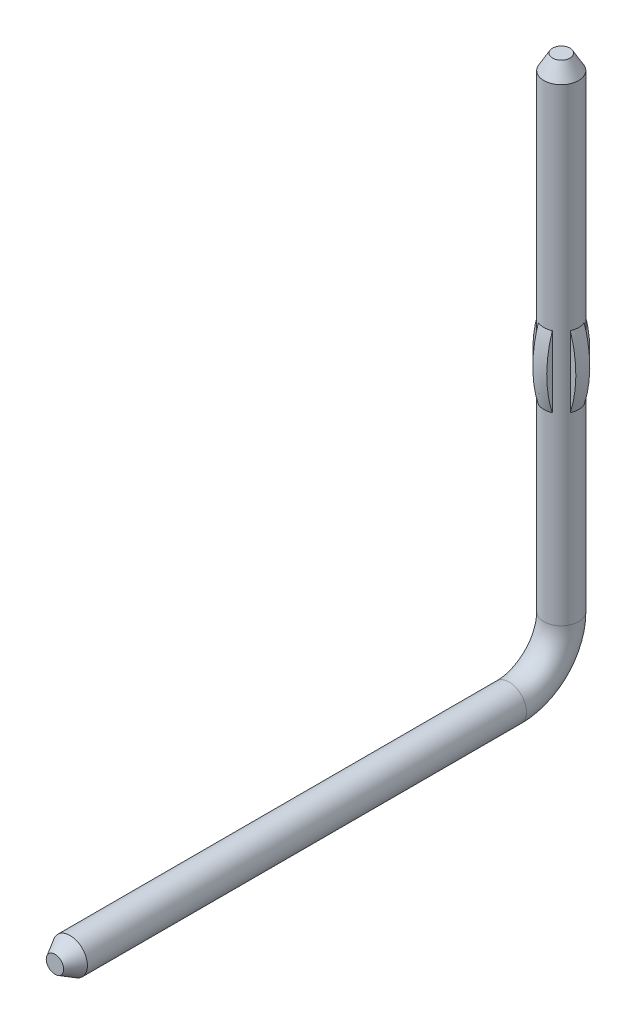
ISO-10303-21;
HEADER;
FILE_DESCRIPTION(('STEP AP214'),'2;1');
FILE_NAME('part.step','',(''),(''),'','','');
FILE_SCHEMA(('AUTOMOTIVE_DESIGN { 1 0 10303 214 1 1 1 1 }'));
ENDSEC;
DATA;
#1=APPLICATION_CONTEXT('core data for automotive mechanical design processes');
#2=APPLICATION_PROTOCOL_DEFINITION('international standard','automotive_design',2000,#1);
#3=PRODUCT_CONTEXT('',#1,'mechanical');
#4=PRODUCT('Part','Part','',(#3));
#5=PRODUCT_RELATED_PRODUCT_CATEGORY('part','',(#4));
#6=PRODUCT_DEFINITION_FORMATION('','',#4);
#7=PRODUCT_DEFINITION_CONTEXT('part definition',#1,'design');
#8=PRODUCT_DEFINITION('design','',#6,#7);
#9=PRODUCT_DEFINITION_SHAPE('','',#8);
#10=(LENGTH_UNIT() NAMED_UNIT(*) SI_UNIT(.MILLI.,.METRE.));
#11=(NAMED_UNIT(*) PLANE_ANGLE_UNIT() SI_UNIT($,.RADIAN.));
#12=(NAMED_UNIT(*) SI_UNIT($,.STERADIAN.) SOLID_ANGLE_UNIT());
#13=UNCERTAINTY_MEASURE_WITH_UNIT(LENGTH_MEASURE(1.E-05),#10,'distance_accuracy_value','');
#14=(GEOMETRIC_REPRESENTATION_CONTEXT(3) GLOBAL_UNCERTAINTY_ASSIGNED_CONTEXT((#13)) GLOBAL_UNIT_ASSIGNED_CONTEXT((#10,
#11,#12)) REPRESENTATION_CONTEXT('',''));
#15=CARTESIAN_POINT('',(0.,0.,0.));
#16=DIRECTION('',(0.,0.,1.));
#17=DIRECTION('',(1.,0.,0.));
#18=AXIS2_PLACEMENT_3D('',#15,#16,#17);
#19=CARTESIAN_POINT('',(3.861265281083,-2.661779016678,6.275));
#20=DIRECTION('',(0.,0.,1.));
#21=DIRECTION('',(0.,-1.,0.));
#22=AXIS2_PLACEMENT_3D('',#19,#20,#21);
#23=PLANE('',#22);
#24=CARTESIAN_POINT('',(4.,-2.8,6.27500000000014));
#25=DIRECTION('',(0.,0.,-1.));
#26=DIRECTION('',(-1.,0.,0.));
#27=AXIS2_PLACEMENT_3D('',#24,#25,#26);
#28=CIRCLE('',#27,0.124999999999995);
#29=CARTESIAN_POINT('',(3.875,-2.8,6.27500000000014));
#30=VERTEX_POINT('',#29);
#31=EDGE_CURVE('E21',#30,#30,#28,.F.);
#32=ORIENTED_EDGE('',*,*,#31,.T.);
#33=EDGE_LOOP('',(#32));
#34=FACE_BOUND('',#33,.T.);
#35=ADVANCED_FACE('F17',(#34),#23,.T.);
#36=CARTESIAN_POINT('',(4.,-2.8,6.05849364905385));
#37=DIRECTION('',(0.,0.,-1.));
#38=DIRECTION('',(-1.,0.,0.));
#39=AXIS2_PLACEMENT_3D('',#36,#37,#38);
#40=CONICAL_SURFACE('',#39,0.25000000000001,0.523598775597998);
#41=CARTESIAN_POINT('',(4.,-2.8,6.05849364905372));
#42=DIRECTION('',(0.,0.,1.));
#43=DIRECTION('',(0.,-1.,0.));
#44=AXIS2_PLACEMENT_3D('',#41,#42,#43);
#45=CIRCLE('',#44,0.25);
#46=CARTESIAN_POINT('',(4.,-3.05,6.05849364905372));
#47=VERTEX_POINT('',#46);
#48=EDGE_CURVE('E417',#47,#47,#45,.T.);
#49=ORIENTED_EDGE('',*,*,#48,.T.);
#50=EDGE_LOOP('',(#49));
#51=FACE_BOUND('',#50,.T.);
#52=ORIENTED_EDGE('',*,*,#31,.F.);
#53=EDGE_LOOP('',(#52));
#54=FACE_BOUND('',#53,.T.);
#55=ADVANCED_FACE('F174',(#51,#54),#40,.T.);
#56=CARTESIAN_POINT('',(4.,-2.8,-0.250000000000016));
#57=DIRECTION('',(0.,0.,1.));
#58=DIRECTION('',(1.,0.,0.));
#59=AXIS2_PLACEMENT_3D('',#56,#57,#58);
#60=CYLINDRICAL_SURFACE('',#59,0.25);
#61=ORIENTED_EDGE('',*,*,#48,.F.);
#62=EDGE_LOOP('',(#61));
#63=FACE_BOUND('',#62,.T.);
#64=CARTESIAN_POINT('',(4.,-2.8,-0.250000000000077));
#65=DIRECTION('',(0.,1.03212393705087E-13,-1.));
#66=DIRECTION('',(0.0627905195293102,-0.998026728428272,-1.03008727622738E-13));
#67=AXIS2_PLACEMENT_3D('',#64,#65,#66);
#68=CIRCLE('',#67,0.25);
#69=CARTESIAN_POINT('',(4.01569762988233,-3.04950668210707,-0.250000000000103));
#70=VERTEX_POINT('',#69);
#71=EDGE_CURVE('E88',#70,#70,#68,.F.);
#72=ORIENTED_EDGE('',*,*,#71,.T.);
#73=EDGE_LOOP('',(#72));
#74=FACE_BOUND('',#73,.T.);
#75=ADVANCED_FACE('F170',(#63,#74),#60,.T.);
#76=CARTESIAN_POINT('',(4.1,0.5696,-0.6775460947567));
#77=DIRECTION('',(1.,0.,0.));
#78=DIRECTION('',(0.,0.,-1.));
#79=AXIS2_PLACEMENT_3D('',#76,#77,#78);
#80=PLANE('',#79);
#81=CARTESIAN_POINT('',(4.1,1.60999999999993,-0.770871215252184));
#82=CARTESIAN_POINT('',(4.1,1.57873023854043,-0.760624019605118));
#83=CARTESIAN_POINT('',(4.1,1.54713852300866,-0.751389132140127));
#84=CARTESIAN_POINT('',(4.1,1.48345199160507,-0.734904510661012));
#85=CARTESIAN_POINT('',(4.1,1.45135734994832,-0.727654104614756));
#86=CARTESIAN_POINT('',(4.1,1.35425691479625,-0.708764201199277));
#87=CARTESIAN_POINT('',(4.1,1.2886698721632,-0.700061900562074));
#88=CARTESIAN_POINT('',(4.1,1.1285416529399,-0.688361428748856));
#89=CARTESIAN_POINT('',(4.1,1.03366604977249,-0.689419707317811));
#90=CARTESIAN_POINT('',(4.1,0.892730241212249,-0.702910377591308));
#91=CARTESIAN_POINT('',(4.1,0.846013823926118,-0.709382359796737));
#92=CARTESIAN_POINT('',(4.1,0.753312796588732,-0.726300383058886));
#93=CARTESIAN_POINT('',(4.1,0.707327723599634,-0.736743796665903));
#94=CARTESIAN_POINT('',(4.1,0.63776992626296,-0.755862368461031));
#95=CARTESIAN_POINT('',(4.1,0.613787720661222,-0.763074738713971));
#96=CARTESIAN_POINT('',(4.1,0.589999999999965,-0.770871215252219));
#97=B_SPLINE_CURVE_WITH_KNOTS('',3,(#81,#82,#83,#84,#85,#86,#87,#88,#89,#90,#91,#92,#93,#94,#95,
#96),.UNSPECIFIED.,.F.,.F.,(4,2,2,2,2,2,2,4),(0.,0.0986850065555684,0.197336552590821,
0.395376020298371,0.678491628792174,0.819849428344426,0.961113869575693,1.03621412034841),.UNSPECIFIED.);
#98=CARTESIAN_POINT('',(4.10000000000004,1.60999999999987,-0.770871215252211));
#99=VERTEX_POINT('',#98);
#100=CARTESIAN_POINT('',(4.10000000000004,0.589999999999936,-0.770871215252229));
#101=VERTEX_POINT('',#100);
#102=EDGE_CURVE('E155',#99,#101,#97,.T.);
#103=ORIENTED_EDGE('',*,*,#102,.T.);
#104=DIRECTION('',(0.,1.,0.));
#105=VECTOR('',#104,1.);
#106=CARTESIAN_POINT('',(4.10000000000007,1.316746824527,-0.770871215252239));
#107=LINE('',#106,#105);
#108=EDGE_CURVE('E405',#101,#99,#107,.T.);
#109=ORIENTED_EDGE('',*,*,#108,.T.);
#110=EDGE_LOOP('',(#103,#109));
#111=FACE_BOUND('',#110,.T.);
#112=ADVANCED_FACE('F166',(#111),#80,.T.);
#113=CARTESIAN_POINT('',(4.1,0.5696,-1.322453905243));
#114=DIRECTION('',(-1.,0.,0.));
#115=DIRECTION('',(0.,0.,1.));
#116=AXIS2_PLACEMENT_3D('',#113,#114,#115);
#117=PLANE('',#116);
#118=CARTESIAN_POINT('',(4.1,0.589999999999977,-1.22912878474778));
#119=CARTESIAN_POINT('',(4.1,0.621269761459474,-1.23937598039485));
#120=CARTESIAN_POINT('',(4.1,0.65286147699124,-1.24861086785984));
#121=CARTESIAN_POINT('',(4.1,0.716548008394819,-1.26509548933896));
#122=CARTESIAN_POINT('',(4.1,0.748642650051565,-1.27234589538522));
#123=CARTESIAN_POINT('',(4.1,0.845743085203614,-1.2912357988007));
#124=CARTESIAN_POINT('',(4.1,0.911330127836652,-1.29993809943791));
#125=CARTESIAN_POINT('',(4.1,1.07145834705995,-1.31163857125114));
#126=CARTESIAN_POINT('',(4.1,1.16633395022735,-1.3105802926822));
#127=CARTESIAN_POINT('',(4.1,1.3072697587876,-1.29708962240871));
#128=CARTESIAN_POINT('',(4.1,1.35398617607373,-1.29061764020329));
#129=CARTESIAN_POINT('',(4.1,1.44668720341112,-1.27369961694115));
#130=CARTESIAN_POINT('',(4.1,1.49267227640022,-1.26325620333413));
#131=CARTESIAN_POINT('',(4.1,1.5622300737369,-1.24413763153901));
#132=CARTESIAN_POINT('',(4.1,1.58621227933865,-1.23692526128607));
#133=CARTESIAN_POINT('',(4.1,1.60999999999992,-1.22912878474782));
#134=B_SPLINE_CURVE_WITH_KNOTS('',3,(#118,#119,#120,#121,#122,#123,#124,#125,#126,#127,#128,
#129,#130,#131,#132,#133),.UNSPECIFIED.,.F.,.F.,(4,2,2,2,2,2,2,4),(0.,0.0986850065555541,
0.197336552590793,0.395376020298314,0.678491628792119,0.819849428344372,0.96111386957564,
1.03621412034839),.UNSPECIFIED.);
#135=CARTESIAN_POINT('',(4.1,0.589999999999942,-1.22912878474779));
#136=VERTEX_POINT('',#135);
#137=CARTESIAN_POINT('',(4.1,1.60999999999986,-1.22912878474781));
#138=VERTEX_POINT('',#137);
#139=EDGE_CURVE('E258',#136,#138,#134,.T.);
#140=ORIENTED_EDGE('',*,*,#139,.T.);
#141=DIRECTION('',(0.,-1.,0.));
#142=VECTOR('',#141,1.);
#143=CARTESIAN_POINT('',(4.1,1.316746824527,-1.22912878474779));
#144=LINE('',#143,#142);
#145=EDGE_CURVE('E101',#138,#136,#144,.T.);
#146=ORIENTED_EDGE('',*,*,#145,.T.);
#147=EDGE_LOOP('',(#140,#146));
#148=FACE_BOUND('',#147,.T.);
#149=ADVANCED_FACE('F135',(#148),#117,.F.);
#150=CARTESIAN_POINT('',(4.,-2.05,-0.25));
#151=DIRECTION('',(-1.,0.,0.));
#152=DIRECTION('',(0.,0.,1.));
#153=AXIS2_PLACEMENT_3D('',#150,#151,#152);
#154=TOROIDAL_SURFACE('',#153,0.75,0.25);
#155=ORIENTED_EDGE('',*,*,#71,.F.);
#156=EDGE_LOOP('',(#155));
#157=FACE_BOUND('',#156,.T.);
#158=CARTESIAN_POINT('',(4.,-2.04999999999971,-1.));
#159=DIRECTION('',(0.,-1.,0.));
#160=DIRECTION('',(0.,0.,-1.));
#161=AXIS2_PLACEMENT_3D('',#158,#159,#160);
#162=CIRCLE('',#161,0.25);
#163=CARTESIAN_POINT('',(4.,-2.04999999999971,-1.25));
#164=VERTEX_POINT('',#163);
#165=EDGE_CURVE('E98',#164,#164,#162,.T.);
#166=ORIENTED_EDGE('',*,*,#165,.T.);
#167=EDGE_LOOP('',(#166));
#168=FACE_BOUND('',#167,.T.);
#169=ADVANCED_FACE('F119',(#157,#168),#154,.T.);
#170=CARTESIAN_POINT('',(4.215907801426,0.5696,-0.9));
#171=DIRECTION('',(0.,0.,1.));
#172=DIRECTION('',(1.,0.,0.));
#173=AXIS2_PLACEMENT_3D('',#170,#171,#172);
#174=PLANE('',#173);
#175=CARTESIAN_POINT('',(4.22912878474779,0.589999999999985,-0.9));
#176=CARTESIAN_POINT('',(4.23937598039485,0.621269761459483,-0.9));
#177=CARTESIAN_POINT('',(4.24861086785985,0.652861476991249,-0.9));
#178=CARTESIAN_POINT('',(4.26509548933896,0.71654800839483,-0.9));
#179=CARTESIAN_POINT('',(4.27234589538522,0.748642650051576,-0.9));
#180=CARTESIAN_POINT('',(4.2912357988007,0.845743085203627,-0.9));
#181=CARTESIAN_POINT('',(4.29993809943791,0.911330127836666,-0.900000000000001));
#182=CARTESIAN_POINT('',(4.31163857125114,1.07145834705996,-0.900000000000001));
#183=CARTESIAN_POINT('',(4.31058029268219,1.16633395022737,-0.9));
#184=CARTESIAN_POINT('',(4.29708962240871,1.30726975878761,-0.9));
#185=CARTESIAN_POINT('',(4.29061764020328,1.35398617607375,-0.9));
#186=CARTESIAN_POINT('',(4.27369961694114,1.44668720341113,-0.9));
#187=CARTESIAN_POINT('',(4.26325620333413,1.49267227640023,-0.9));
#188=CARTESIAN_POINT('',(4.24413763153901,1.56223007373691,-0.9));
#189=CARTESIAN_POINT('',(4.23692526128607,1.58621227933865,-0.9));
#190=CARTESIAN_POINT('',(4.22912878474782,1.60999999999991,-0.9));
#191=B_SPLINE_CURVE_WITH_KNOTS('',3,(#175,#176,#177,#178,#179,#180,#181,#182,#183,#184,#185,
#186,#187,#188,#189,#190),.UNSPECIFIED.,.F.,.F.,(4,2,2,2,2,2,2,4),(0.,0.0986850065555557,
0.197336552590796,0.39537602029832,0.678491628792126,0.819849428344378,0.961113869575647,
1.03621412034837),.UNSPECIFIED.);
#192=CARTESIAN_POINT('',(4.22912878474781,0.589999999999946,-0.900000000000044));
#193=VERTEX_POINT('',#192);
#194=CARTESIAN_POINT('',(4.22912878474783,1.60999999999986,-0.900000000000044));
#195=VERTEX_POINT('',#194);
#196=EDGE_CURVE('E80',#193,#195,#191,.T.);
#197=ORIENTED_EDGE('',*,*,#196,.T.);
#198=DIRECTION('',(0.,-1.,0.));
#199=VECTOR('',#198,1.);
#200=CARTESIAN_POINT('',(4.22912878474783,1.316746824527,-0.900000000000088));
#201=LINE('',#200,#199);
#202=EDGE_CURVE('E86',#195,#193,#201,.T.);
#203=ORIENTED_EDGE('',*,*,#202,.T.);
#204=EDGE_LOOP('',(#197,#203));
#205=FACE_BOUND('',#204,.T.);
#206=ADVANCED_FACE('F85',(#205),#174,.T.);
#207=CARTESIAN_POINT('',(4.,1.1,-2.4465));
#208=DIRECTION('',(1.,0.,0.));
#209=DIRECTION('',(0.,0.299058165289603,0.95423488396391));
#210=AXIS2_PLACEMENT_3D('',#207,#208,#209);
#211=CIRCLE('',#210,1.7715);
#212=TRIMMED_CURVE('',#211,(PARAMETER_VALUE(-0.31169960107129)),
(PARAMETER_VALUE(0.919110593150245)),.T.,.PARAMETER.);
#213=CARTESIAN_POINT('',(4.,1.1,-1.));
#214=DIRECTION('',(0.,-1.,0.));
#215=AXIS1_PLACEMENT('',#213,#214);
#216=SURFACE_OF_REVOLUTION('',#212,#215);
#217=CARTESIAN_POINT('',(4.22912878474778,0.589999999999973,-1.1));
#218=CARTESIAN_POINT('',(4.23937598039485,0.62126976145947,-1.1));
#219=CARTESIAN_POINT('',(4.24861086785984,0.652861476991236,-1.1));
#220=CARTESIAN_POINT('',(4.26509548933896,0.716548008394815,-1.1));
#221=CARTESIAN_POINT('',(4.27234589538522,0.74864265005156,-1.1));
#222=CARTESIAN_POINT('',(4.2912357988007,0.845743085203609,-1.1));
#223=CARTESIAN_POINT('',(4.29993809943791,0.911330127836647,-1.1));
#224=CARTESIAN_POINT('',(4.31163857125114,1.07145834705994,-1.1));
#225=CARTESIAN_POINT('',(4.31058029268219,1.16633395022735,-1.1));
#226=CARTESIAN_POINT('',(4.29708962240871,1.30726975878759,-1.1));
#227=CARTESIAN_POINT('',(4.29061764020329,1.35398617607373,-1.1));
#228=CARTESIAN_POINT('',(4.27369961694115,1.44668720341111,-1.1));
#229=CARTESIAN_POINT('',(4.26325620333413,1.49267227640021,-1.1));
#230=CARTESIAN_POINT('',(4.24413763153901,1.5622300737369,-1.1));
#231=CARTESIAN_POINT('',(4.23692526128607,1.58621227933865,-1.1));
#232=CARTESIAN_POINT('',(4.22912878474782,1.60999999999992,-1.1));
#233=B_SPLINE_CURVE_WITH_KNOTS('',3,(#217,#218,#219,#220,#221,#222,#223,#224,#225,#226,#227,
#228,#229,#230,#231,#232),.UNSPECIFIED.,.F.,.F.,(4,2,2,2,2,2,2,4),(0.,0.0986850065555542,
0.197336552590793,0.395376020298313,0.678491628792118,0.819849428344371,0.961113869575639,
1.0362141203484),.UNSPECIFIED.);
#234=CARTESIAN_POINT('',(4.22912878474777,0.58999999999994,-1.10000000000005));
#235=VERTEX_POINT('',#234);
#236=CARTESIAN_POINT('',(4.22912878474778,1.60999999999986,-1.10000000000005));
#237=VERTEX_POINT('',#236);
#238=EDGE_CURVE('E87',#235,#237,#233,.T.);
#239=ORIENTED_EDGE('',*,*,#238,.T.);
#240=CARTESIAN_POINT('',(4.,1.60999999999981,-1.));
#241=DIRECTION('',(0.,-1.,0.));
#242=DIRECTION('',(0.,0.,-1.));
#243=AXIS2_PLACEMENT_3D('',#240,#241,#242);
#244=CIRCLE('',#243,0.25);
#245=EDGE_CURVE('E92',#237,#195,#244,.T.);
#246=ORIENTED_EDGE('',*,*,#245,.T.);
#247=ORIENTED_EDGE('',*,*,#196,.F.);
#248=CARTESIAN_POINT('',(4.,0.589999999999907,-1.));
#249=DIRECTION('',(0.,-1.,0.));
#250=DIRECTION('',(0.,0.,-1.));
#251=AXIS2_PLACEMENT_3D('',#248,#249,#250);
#252=CIRCLE('',#251,0.25);
#253=EDGE_CURVE('E94',#193,#235,#252,.F.);
#254=ORIENTED_EDGE('',*,*,#253,.T.);
#255=EDGE_LOOP('',(#239,#246,#247,#254));
#256=FACE_BOUND('',#255,.T.);
#257=ADVANCED_FACE('F96',(#256),#216,.T.);
#258=CARTESIAN_POINT('',(4.215907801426,0.5696,-1.1));
#259=DIRECTION('',(0.,0.,1.));
#260=DIRECTION('',(1.,0.,0.));
#261=AXIS2_PLACEMENT_3D('',#258,#259,#260);
#262=PLANE('',#261);
#263=ORIENTED_EDGE('',*,*,#238,.F.);
#264=DIRECTION('',(0.,1.,0.));
#265=VECTOR('',#264,1.);
#266=CARTESIAN_POINT('',(4.22912878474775,1.316746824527,-1.10000000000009));
#267=LINE('',#266,#265);
#268=EDGE_CURVE('E105',#235,#237,#267,.T.);
#269=ORIENTED_EDGE('',*,*,#268,.T.);
#270=EDGE_LOOP('',(#263,#269));
#271=FACE_BOUND('',#270,.T.);
#272=ADVANCED_FACE('F114',(#271),#262,.F.);
#273=CARTESIAN_POINT('',(3.9,0.5696,-0.6775460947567));
#274=DIRECTION('',(1.,0.,0.));
#275=DIRECTION('',(0.,0.,-1.));
#276=AXIS2_PLACEMENT_3D('',#273,#274,#275);
#277=PLANE('',#276);
#278=CARTESIAN_POINT('',(3.9,0.589999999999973,-0.770871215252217));
#279=CARTESIAN_POINT('',(3.9,0.621269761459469,-0.76062401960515));
#280=CARTESIAN_POINT('',(3.9,0.652861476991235,-0.751389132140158));
#281=CARTESIAN_POINT('',(3.9,0.716548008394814,-0.734904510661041));
#282=CARTESIAN_POINT('',(3.9,0.74864265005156,-0.727654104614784));
#283=CARTESIAN_POINT('',(3.9,0.845743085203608,-0.708764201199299));
#284=CARTESIAN_POINT('',(3.9,0.911330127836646,-0.700061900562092));
#285=CARTESIAN_POINT('',(3.9,1.07145834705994,-0.688361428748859));
#286=CARTESIAN_POINT('',(3.9,1.16633395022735,-0.689419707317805));
#287=CARTESIAN_POINT('',(3.9,1.30726975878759,-0.702910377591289));
#288=CARTESIAN_POINT('',(3.9,1.35398617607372,-0.709382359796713));
#289=CARTESIAN_POINT('',(3.9,1.44668720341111,-0.726300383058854));
#290=CARTESIAN_POINT('',(3.9,1.49267227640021,-0.736743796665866));
#291=CARTESIAN_POINT('',(3.9,1.5622300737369,-0.755862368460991));
#292=CARTESIAN_POINT('',(3.9,1.58621227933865,-0.763074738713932));
#293=CARTESIAN_POINT('',(3.9,1.60999999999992,-0.770871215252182));
#294=B_SPLINE_CURVE_WITH_KNOTS('',3,(#278,#279,#280,#281,#282,#283,#284,#285,#286,#287,#288,
#289,#290,#291,#292,#293),.UNSPECIFIED.,.F.,.F.,(4,2,2,2,2,2,2,4),(0.,0.0986850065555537,
0.197336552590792,0.395376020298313,0.678491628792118,0.819849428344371,0.961113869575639,
1.0362141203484),.UNSPECIFIED.);
#295=CARTESIAN_POINT('',(3.90000000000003,0.58999999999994,-0.770871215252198));
#296=VERTEX_POINT('',#295);
#297=CARTESIAN_POINT('',(3.90000000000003,1.60999999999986,-0.770871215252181));
#298=VERTEX_POINT('',#297);
#299=EDGE_CURVE('E150',#296,#298,#294,.T.);
#300=ORIENTED_EDGE('',*,*,#299,.T.);
#301=DIRECTION('',(0.,-1.,0.));
#302=VECTOR('',#301,1.);
#303=CARTESIAN_POINT('',(3.90000000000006,1.316746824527,-0.77087121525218));
#304=LINE('',#303,#302);
#305=EDGE_CURVE('E226',#298,#296,#304,.T.);
#306=ORIENTED_EDGE('',*,*,#305,.T.);
#307=EDGE_LOOP('',(#300,#306));
#308=FACE_BOUND('',#307,.T.);
#309=ADVANCED_FACE('F141',(#308),#277,.F.);
#310=CARTESIAN_POINT('',(4.,1.1,-2.4465));
#311=DIRECTION('',(1.,0.,0.));
#312=DIRECTION('',(0.,0.299058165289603,0.95423488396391));
#313=AXIS2_PLACEMENT_3D('',#310,#311,#312);
#314=CIRCLE('',#313,1.7715);
#315=TRIMMED_CURVE('',#314,(PARAMETER_VALUE(-0.31169960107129)),
(PARAMETER_VALUE(0.919110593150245)),.T.,.PARAMETER.);
#316=CARTESIAN_POINT('',(4.,1.1,-1.));
#317=DIRECTION('',(0.,-1.,0.));
#318=AXIS1_PLACEMENT('',#316,#317);
#319=SURFACE_OF_REVOLUTION('',#315,#318);
#320=CARTESIAN_POINT('',(4.,0.589999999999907,-1.));
#321=DIRECTION('',(0.,-1.,0.));
#322=DIRECTION('',(0.,0.,-1.));
#323=AXIS2_PLACEMENT_3D('',#320,#321,#322);
#324=CIRCLE('',#323,0.25);
#325=EDGE_CURVE('E240',#296,#101,#324,.F.);
#326=ORIENTED_EDGE('',*,*,#325,.T.);
#327=ORIENTED_EDGE('',*,*,#102,.F.);
#328=CARTESIAN_POINT('',(4.,1.60999999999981,-1.));
#329=DIRECTION('',(0.,-1.,0.));
#330=DIRECTION('',(0.,0.,-1.));
#331=AXIS2_PLACEMENT_3D('',#328,#329,#330);
#332=CIRCLE('',#331,0.25);
#333=EDGE_CURVE('E223',#99,#298,#332,.T.);
#334=ORIENTED_EDGE('',*,*,#333,.T.);
#335=ORIENTED_EDGE('',*,*,#299,.F.);
#336=EDGE_LOOP('',(#326,#327,#334,#335));
#337=FACE_BOUND('',#336,.T.);
#338=ADVANCED_FACE('F115',(#337),#319,.T.);
#339=CARTESIAN_POINT('',(3.9,0.5696,-1.322453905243));
#340=DIRECTION('',(-1.,0.,0.));
#341=DIRECTION('',(0.,0.,1.));
#342=AXIS2_PLACEMENT_3D('',#339,#340,#341);
#343=PLANE('',#342);
#344=CARTESIAN_POINT('',(3.9,1.60999999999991,-1.22912878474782));
#345=CARTESIAN_POINT('',(3.9,1.57873023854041,-1.23937598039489));
#346=CARTESIAN_POINT('',(3.9,1.54713852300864,-1.24861086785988));
#347=CARTESIAN_POINT('',(3.9,1.48345199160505,-1.26509548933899));
#348=CARTESIAN_POINT('',(3.9,1.4513573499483,-1.27234589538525));
#349=CARTESIAN_POINT('',(3.9,1.35425691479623,-1.29123579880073));
#350=CARTESIAN_POINT('',(3.9,1.28866987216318,-1.29993809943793));
#351=CARTESIAN_POINT('',(3.9,1.12854165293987,-1.31163857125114));
#352=CARTESIAN_POINT('',(3.9,1.03366604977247,-1.31058029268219));
#353=CARTESIAN_POINT('',(3.9,0.892730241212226,-1.29708962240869));
#354=CARTESIAN_POINT('',(3.9,0.846013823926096,-1.29061764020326));
#355=CARTESIAN_POINT('',(3.9,0.75331279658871,-1.27369961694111));
#356=CARTESIAN_POINT('',(3.9,0.707327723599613,-1.26325620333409));
#357=CARTESIAN_POINT('',(3.9,0.63776992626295,-1.24413763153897));
#358=CARTESIAN_POINT('',(3.9,0.613787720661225,-1.23692526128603));
#359=CARTESIAN_POINT('',(3.9,0.58999999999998,-1.22912878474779));
#360=B_SPLINE_CURVE_WITH_KNOTS('',3,(#344,#345,#346,#347,#348,#349,#350,#351,#352,#353,#354,
#355,#356,#357,#358,#359),.UNSPECIFIED.,.F.,.F.,(4,2,2,2,2,2,2,4),(0.,0.0986850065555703,
0.197336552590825,0.395376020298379,0.678491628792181,0.819849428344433,0.961113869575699,
1.03621412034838),.UNSPECIFIED.);
#361=CARTESIAN_POINT('',(3.89999999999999,1.60999999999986,-1.2291287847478));
#362=VERTEX_POINT('',#361);
#363=CARTESIAN_POINT('',(3.89999999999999,0.589999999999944,-1.22912878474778));
#364=VERTEX_POINT('',#363);
#365=EDGE_CURVE('E161',#362,#364,#360,.T.);
#366=ORIENTED_EDGE('',*,*,#365,.T.);
#367=DIRECTION('',(0.,1.,0.));
#368=VECTOR('',#367,1.);
#369=CARTESIAN_POINT('',(3.89999999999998,1.316746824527,-1.22912878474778));
#370=LINE('',#369,#368);
#371=EDGE_CURVE('E231',#364,#362,#370,.T.);
#372=ORIENTED_EDGE('',*,*,#371,.T.);
#373=EDGE_LOOP('',(#366,#372));
#374=FACE_BOUND('',#373,.T.);
#375=ADVANCED_FACE('F147',(#374),#343,.T.);
#376=CARTESIAN_POINT('',(4.,1.1,-2.4465));
#377=DIRECTION('',(1.,0.,0.));
#378=DIRECTION('',(0.,0.299058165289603,0.95423488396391));
#379=AXIS2_PLACEMENT_3D('',#376,#377,#378);
#380=CIRCLE('',#379,1.7715);
#381=TRIMMED_CURVE('',#380,(PARAMETER_VALUE(-0.31169960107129)),
(PARAMETER_VALUE(0.919110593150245)),.T.,.PARAMETER.);
#382=CARTESIAN_POINT('',(4.,1.1,-1.));
#383=DIRECTION('',(0.,-1.,0.));
#384=AXIS1_PLACEMENT('',#382,#383);
#385=SURFACE_OF_REVOLUTION('',#381,#384);
#386=CARTESIAN_POINT('',(4.,1.60999999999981,-1.));
#387=DIRECTION('',(0.,-1.,0.));
#388=DIRECTION('',(0.,0.,-1.));
#389=AXIS2_PLACEMENT_3D('',#386,#387,#388);
#390=CIRCLE('',#389,0.25);
#391=EDGE_CURVE('E229',#362,#138,#390,.T.);
#392=ORIENTED_EDGE('',*,*,#391,.T.);
#393=ORIENTED_EDGE('',*,*,#139,.F.);
#394=CARTESIAN_POINT('',(4.,0.589999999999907,-1.));
#395=DIRECTION('',(0.,-1.,0.));
#396=DIRECTION('',(0.,0.,-1.));
#397=AXIS2_PLACEMENT_3D('',#394,#395,#396);
#398=CIRCLE('',#397,0.25);
#399=EDGE_CURVE('E237',#136,#364,#398,.F.);
#400=ORIENTED_EDGE('',*,*,#399,.T.);
#401=ORIENTED_EDGE('',*,*,#365,.F.);
#402=EDGE_LOOP('',(#392,#393,#400,#401));
#403=FACE_BOUND('',#402,.T.);
#404=ADVANCED_FACE('F209',(#403),#385,.T.);
#405=CARTESIAN_POINT('',(3.784092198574,0.5696,-0.9));
#406=DIRECTION('',(0.,0.,-1.));
#407=DIRECTION('',(-1.,0.,0.));
#408=AXIS2_PLACEMENT_3D('',#405,#406,#407);
#409=PLANE('',#408);
#410=CARTESIAN_POINT('',(3.77087121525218,1.60999999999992,-0.9));
#411=CARTESIAN_POINT('',(3.76062401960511,1.57873023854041,-0.9));
#412=CARTESIAN_POINT('',(3.75138913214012,1.54713852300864,-0.9));
#413=CARTESIAN_POINT('',(3.73490451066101,1.48345199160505,-0.9));
#414=CARTESIAN_POINT('',(3.72765410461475,1.4513573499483,-0.9));
#415=CARTESIAN_POINT('',(3.70876420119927,1.35425691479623,-0.9));
#416=CARTESIAN_POINT('',(3.70006190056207,1.28866987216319,-0.900000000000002));
#417=CARTESIAN_POINT('',(3.68836142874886,1.12854165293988,-0.900000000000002));
#418=CARTESIAN_POINT('',(3.68941970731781,1.03366604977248,-0.9));
#419=CARTESIAN_POINT('',(3.70291037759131,0.89273024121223,-0.9));
#420=CARTESIAN_POINT('',(3.70938235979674,0.846013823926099,-0.9));
#421=CARTESIAN_POINT('',(3.72630038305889,0.753312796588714,-0.9));
#422=CARTESIAN_POINT('',(3.73674379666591,0.707327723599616,-0.9));
#423=CARTESIAN_POINT('',(3.75586236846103,0.637769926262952,-0.9));
#424=CARTESIAN_POINT('',(3.76307473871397,0.613787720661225,-0.9));
#425=CARTESIAN_POINT('',(3.77087121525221,0.589999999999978,-0.9));
#426=B_SPLINE_CURVE_WITH_KNOTS('',3,(#410,#411,#412,#413,#414,#415,#416,#417,#418,#419,#420,
#421,#422,#423,#424,#425),.UNSPECIFIED.,.F.,.F.,(4,2,2,2,2,2,2,4),(0.,0.0986850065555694,
0.197336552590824,0.395376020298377,0.67849162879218,0.819849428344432,0.961113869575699,
1.03621412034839),.UNSPECIFIED.);
#427=CARTESIAN_POINT('',(3.7708712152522,1.60999999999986,-0.899999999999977));
#428=VERTEX_POINT('',#427);
#429=CARTESIAN_POINT('',(3.77087121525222,0.589999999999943,-0.899999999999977));
#430=VERTEX_POINT('',#429);
#431=EDGE_CURVE('E248',#428,#430,#426,.T.);
#432=ORIENTED_EDGE('',*,*,#431,.T.);
#433=DIRECTION('',(0.,1.,0.));
#434=VECTOR('',#433,1.);
#435=CARTESIAN_POINT('',(3.77087121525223,1.316746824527,-0.899999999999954));
#436=LINE('',#435,#434);
#437=EDGE_CURVE('E219',#430,#428,#436,.T.);
#438=ORIENTED_EDGE('',*,*,#437,.T.);
#439=EDGE_LOOP('',(#432,#438));
#440=FACE_BOUND('',#439,.T.);
#441=ADVANCED_FACE('F207',(#440),#409,.F.);
#442=CARTESIAN_POINT('',(4.,1.1,-2.4465));
#443=DIRECTION('',(1.,0.,0.));
#444=DIRECTION('',(0.,0.299058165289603,0.95423488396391));
#445=AXIS2_PLACEMENT_3D('',#442,#443,#444);
#446=CIRCLE('',#445,1.7715);
#447=TRIMMED_CURVE('',#446,(PARAMETER_VALUE(-0.31169960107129)),
(PARAMETER_VALUE(0.919110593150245)),.T.,.PARAMETER.);
#448=CARTESIAN_POINT('',(4.,1.1,-1.));
#449=DIRECTION('',(0.,-1.,0.));
#450=AXIS1_PLACEMENT('',#448,#449);
#451=SURFACE_OF_REVOLUTION('',#447,#450);
#452=CARTESIAN_POINT('',(3.77087121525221,0.589999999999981,-1.1));
#453=CARTESIAN_POINT('',(3.76062401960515,0.621269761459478,-1.1));
#454=CARTESIAN_POINT('',(3.75138913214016,0.652861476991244,-1.1));
#455=CARTESIAN_POINT('',(3.73490451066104,0.716548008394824,-1.1));
#456=CARTESIAN_POINT('',(3.72765410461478,0.74864265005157,-1.1));
#457=CARTESIAN_POINT('',(3.7087642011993,0.845743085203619,-1.1));
#458=CARTESIAN_POINT('',(3.70006190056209,0.911330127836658,-1.1));
#459=CARTESIAN_POINT('',(3.68836142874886,1.07145834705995,-1.1));
#460=CARTESIAN_POINT('',(3.68941970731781,1.16633395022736,-1.1));
#461=CARTESIAN_POINT('',(3.70291037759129,1.30726975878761,-1.1));
#462=CARTESIAN_POINT('',(3.70938235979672,1.35398617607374,-1.1));
#463=CARTESIAN_POINT('',(3.72630038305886,1.44668720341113,-1.1));
#464=CARTESIAN_POINT('',(3.73674379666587,1.49267227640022,-1.1));
#465=CARTESIAN_POINT('',(3.75586236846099,1.56223007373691,-1.1));
#466=CARTESIAN_POINT('',(3.76307473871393,1.58621227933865,-1.1));
#467=CARTESIAN_POINT('',(3.77087121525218,1.60999999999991,-1.1));
#468=B_SPLINE_CURVE_WITH_KNOTS('',3,(#452,#453,#454,#455,#456,#457,#458,#459,#460,#461,#462,
#463,#464,#465,#466,#467),.UNSPECIFIED.,.F.,.F.,(4,2,2,2,2,2,2,4),(0.,0.0986850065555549,
0.197336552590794,0.395376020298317,0.678491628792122,0.819849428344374,0.961113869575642,
1.03621412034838),.UNSPECIFIED.);
#469=CARTESIAN_POINT('',(3.7708712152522,0.589999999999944,-1.09999999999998));
#470=VERTEX_POINT('',#469);
#471=CARTESIAN_POINT('',(3.77087121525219,1.60999999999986,-1.09999999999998));
#472=VERTEX_POINT('',#471);
#473=EDGE_CURVE('E35',#470,#472,#468,.T.);
#474=ORIENTED_EDGE('',*,*,#473,.F.);
#475=CARTESIAN_POINT('',(4.,0.589999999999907,-1.));
#476=DIRECTION('',(0.,-1.,0.));
#477=DIRECTION('',(0.,0.,-1.));
#478=AXIS2_PLACEMENT_3D('',#475,#476,#477);
#479=CIRCLE('',#478,0.25);
#480=EDGE_CURVE('E217',#470,#430,#479,.F.);
#481=ORIENTED_EDGE('',*,*,#480,.T.);
#482=ORIENTED_EDGE('',*,*,#431,.F.);
#483=CARTESIAN_POINT('',(4.,1.60999999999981,-1.));
#484=DIRECTION('',(0.,-1.,0.));
#485=DIRECTION('',(0.,0.,-1.));
#486=AXIS2_PLACEMENT_3D('',#483,#484,#485);
#487=CIRCLE('',#486,0.25);
#488=EDGE_CURVE('E222',#428,#472,#487,.T.);
#489=ORIENTED_EDGE('',*,*,#488,.T.);
#490=EDGE_LOOP('',(#474,#481,#482,#489));
#491=FACE_BOUND('',#490,.T.);
#492=ADVANCED_FACE('F203',(#491),#451,.T.);
#493=CARTESIAN_POINT('',(3.784092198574,0.5696,-1.1));
#494=DIRECTION('',(0.,0.,-1.));
#495=DIRECTION('',(-1.,0.,0.));
#496=AXIS2_PLACEMENT_3D('',#493,#494,#495);
#497=PLANE('',#496);
#498=ORIENTED_EDGE('',*,*,#473,.T.);
#499=DIRECTION('',(0.,-1.,0.));
#500=VECTOR('',#499,1.);
#501=CARTESIAN_POINT('',(3.77087121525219,1.316746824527,-1.09999999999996));
#502=LINE('',#501,#500);
#503=EDGE_CURVE('E436',#472,#470,#502,.T.);
#504=ORIENTED_EDGE('',*,*,#503,.T.);
#505=EDGE_LOOP('',(#498,#504));
#506=FACE_BOUND('',#505,.T.);
#507=ADVANCED_FACE('F198',(#506),#497,.T.);
#508=CARTESIAN_POINT('',(4.,4.68349364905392,-1.));
#509=DIRECTION('',(0.,-1.,0.));
#510=DIRECTION('',(0.,0.,-1.));
#511=AXIS2_PLACEMENT_3D('',#508,#509,#510);
#512=CYLINDRICAL_SURFACE('',#511,0.25);
#513=ORIENTED_EDGE('',*,*,#165,.F.);
#514=EDGE_LOOP('',(#513));
#515=FACE_BOUND('',#514,.T.);
#516=ORIENTED_EDGE('',*,*,#399,.F.);
#517=ORIENTED_EDGE('',*,*,#145,.F.);
#518=ORIENTED_EDGE('',*,*,#391,.F.);
#519=ORIENTED_EDGE('',*,*,#371,.F.);
#520=EDGE_LOOP('',(#516,#517,#518,#519));
#521=FACE_BOUND('',#520,.T.);
#522=CARTESIAN_POINT('',(4.,4.68349364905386,-1.));
#523=DIRECTION('',(0.,-1.,0.));
#524=DIRECTION('',(0.,0.,-1.));
#525=AXIS2_PLACEMENT_3D('',#522,#523,#524);
#526=CIRCLE('',#525,0.250000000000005);
#527=CARTESIAN_POINT('',(4.,4.68349364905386,-1.25));
#528=VERTEX_POINT('',#527);
#529=EDGE_CURVE('E27',#528,#528,#526,.T.);
#530=ORIENTED_EDGE('',*,*,#529,.T.);
#531=EDGE_LOOP('',(#530));
#532=FACE_BOUND('',#531,.T.);
#533=ORIENTED_EDGE('',*,*,#488,.F.);
#534=ORIENTED_EDGE('',*,*,#437,.F.);
#535=ORIENTED_EDGE('',*,*,#480,.F.);
#536=ORIENTED_EDGE('',*,*,#503,.F.);
#537=EDGE_LOOP('',(#533,#534,#535,#536));
#538=FACE_BOUND('',#537,.T.);
#539=ORIENTED_EDGE('',*,*,#108,.F.);
#540=ORIENTED_EDGE('',*,*,#325,.F.);
#541=ORIENTED_EDGE('',*,*,#305,.F.);
#542=ORIENTED_EDGE('',*,*,#333,.F.);
#543=EDGE_LOOP('',(#539,#540,#541,#542));
#544=FACE_BOUND('',#543,.T.);
#545=ORIENTED_EDGE('',*,*,#253,.F.);
#546=ORIENTED_EDGE('',*,*,#202,.F.);
#547=ORIENTED_EDGE('',*,*,#245,.F.);
#548=ORIENTED_EDGE('',*,*,#268,.F.);
#549=EDGE_LOOP('',(#545,#546,#547,#548));
#550=FACE_BOUND('',#549,.T.);
#551=ADVANCED_FACE('F90',(#515,#521,#532,#538,#544,#550),#512,.T.);
#552=CARTESIAN_POINT('',(4.,4.90000000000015,-1.));
#553=DIRECTION('',(0.,-1.,0.));
#554=DIRECTION('',(0.,0.,-1.));
#555=AXIS2_PLACEMENT_3D('',#552,#553,#554);
#556=CONICAL_SURFACE('',#555,0.12499999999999,0.523598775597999);
#557=ORIENTED_EDGE('',*,*,#529,.F.);
#558=EDGE_LOOP('',(#557));
#559=FACE_BOUND('',#558,.T.);
#560=CARTESIAN_POINT('',(4.,4.90000000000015,-1.));
#561=DIRECTION('',(0.,-1.,0.));
#562=DIRECTION('',(0.,0.,-1.));
#563=AXIS2_PLACEMENT_3D('',#560,#561,#562);
#564=CIRCLE('',#563,0.12499999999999);
#565=CARTESIAN_POINT('',(4.,4.90000000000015,-1.12499999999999));
#566=VERTEX_POINT('',#565);
#567=EDGE_CURVE('E11',#566,#566,#564,.T.);
#568=ORIENTED_EDGE('',*,*,#567,.T.);
#569=EDGE_LOOP('',(#568));
#570=FACE_BOUND('',#569,.T.);
#571=ADVANCED_FACE('F186',(#559,#570),#556,.T.);
#572=CARTESIAN_POINT('',(3.861265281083,4.9,-0.861779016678));
#573=DIRECTION('',(0.,-1.,0.));
#574=DIRECTION('',(0.,0.,-1.));
#575=AXIS2_PLACEMENT_3D('',#572,#573,#574);
#576=PLANE('',#575);
#577=ORIENTED_EDGE('',*,*,#567,.F.);
#578=EDGE_LOOP('',(#577));
#579=FACE_BOUND('',#578,.T.);
#580=ADVANCED_FACE('F19',(#579),#576,.F.);
#581=CLOSED_SHELL('',(#35,#55,#75,#112,#149,#169,#206,#257,#272,#309,#338,#375,#404,#441,#492,
#507,#551,#571,#580));
#582=MANIFOLD_SOLID_BREP('B1',#581);
#583=ADVANCED_BREP_SHAPE_REPRESENTATION('',(#18,#582),#14);
#584=SHAPE_DEFINITION_REPRESENTATION(#9,#583);
ENDSEC;
END-ISO-10303-21;
